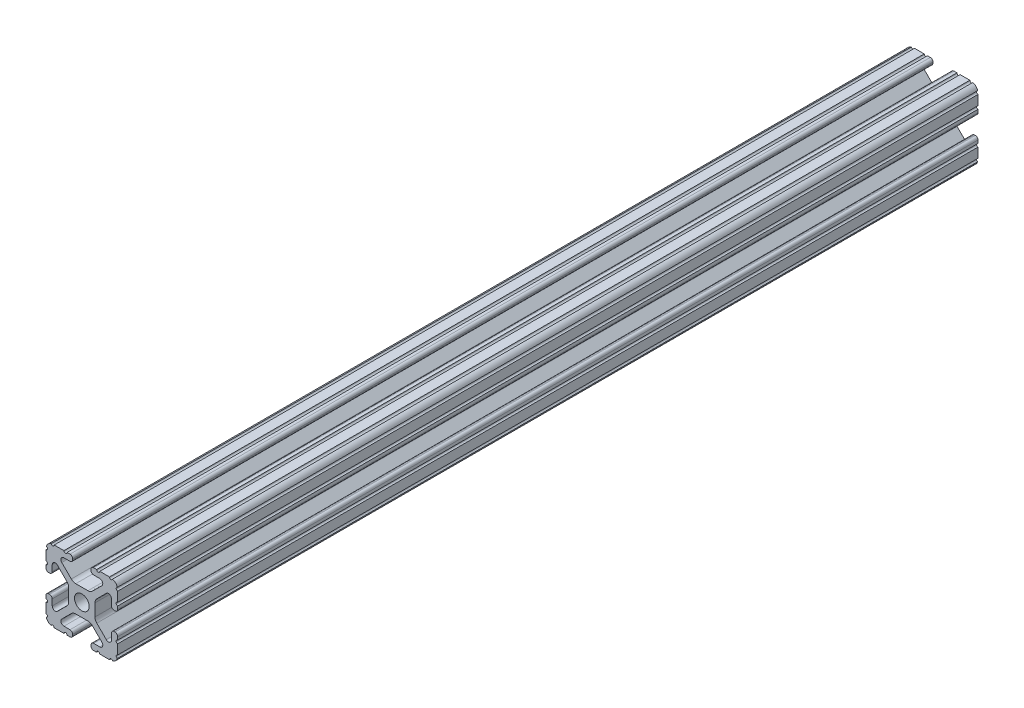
from build123d import *

# Parameters (mm, degrees)
BOSS_EXTRUDE1_DEPTH     = 152.4
CUT_EXTRUDE1_DEPTH      = 154.454683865
CUT_EXTRUDE1_DEPTH_BACK = 154.454683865
SKETCH5_R               = 0.55245


with BuildPart() as part:
    # Sketch4 → Boss-Extrude1 (new, symmetric)
    with BuildSketch(Plane.XY):
        with BuildLine():
            Line((4.190365, -12.7), (10.11729625, -12.7))
            ThreePointArc((10.11729625, -12.7), (11.943543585, -11.943543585), (12.7, -10.11729625))
            Line((12.7, -10.11729625), (12.7, -4.190365))
            ThreePointArc((12.7, -4.190365), (12.42492494, -3.52627506), (11.760835, -3.2512))
            Line((11.760835, -3.2512), (11.429365, -3.2512))
            ThreePointArc((11.429365, -3.2512), (10.76527506, -3.52627506), (10.4902, -4.190365))
            Line((10.4902, -4.190365), (10.4902, -6.348478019))
            ThreePointArc((10.4902, -6.348478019), (9.830707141, -7.335478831), (8.666460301, -7.103895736))
            Line((8.666460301, -7.103895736), (5.299899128, -3.737334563))
            ThreePointArc((5.299899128, -3.737334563), (4.817571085, -3.015479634), (4.6482, -2.16399369))
            Line((4.6482, -2.16399369), (4.6482, 0))
            Line((4.6482, 0), (2.6035, 0))
            ThreePointArc((2.6035, 0), (1.840952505, -1.840952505), (0, -2.6035))
            Line((0, -2.6035), (0, -4.6482))
            Line((0, -4.6482), (2.16399369, -4.6482))
            ThreePointArc((2.16399369, -4.6482), (3.015479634, -4.817571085), (3.737334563, -5.299899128))
            Line((3.737334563, -5.299899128), (7.103895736, -8.666460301))
            ThreePointArc((7.103895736, -8.666460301), (7.335478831, -9.830707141), (6.348478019, -10.4902))
            Line((6.348478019, -10.4902), (4.190365, -10.4902))
            ThreePointArc((4.190365, -10.4902), (3.52627506, -10.76527506), (3.2512, -11.429365))
            Line((3.2512, -11.429365), (3.2512, -11.760835))
            ThreePointArc((3.2512, -11.760835), (3.52627506, -12.42492494), (4.190365, -12.7))
        make_face()
    extrude(amount=BOSS_EXTRUDE1_DEPTH, both=True)

    # Sketch5 → Cut-Extrude1 (cut, two sides: drawn at the far end of the back side and taken through both)
    with BuildSketch(Plane.XY.offset(-CUT_EXTRUDE1_DEPTH_BACK)):
        with Locations((10.356153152, -12.7)):
            Circle(SKETCH5_R)
        with Locations((5.796028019, -12.7)):
            Circle(SKETCH5_R)
        with Locations((12.7, -10.356153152)):
            Circle(SKETCH5_R)
        with Locations((12.7, -5.796028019)):
            Circle(SKETCH5_R)
    extrude(amount=CUT_EXTRUDE1_DEPTH + CUT_EXTRUDE1_DEPTH_BACK, mode=Mode.SUBTRACT)

    # Mirror1: part across plane


with BuildPart() as part_1:
    add(part.part)
    add(part.part.mirror(Plane(origin=(0, 0, 0), x_dir=(0, 0, 1), z_dir=(1, 0, 0))))

    # Mirror2: part across plane


with BuildPart() as part_2:
    add(part_1.part)
    add(part_1.part.mirror(Plane.ZX))


solid = part_2.part
